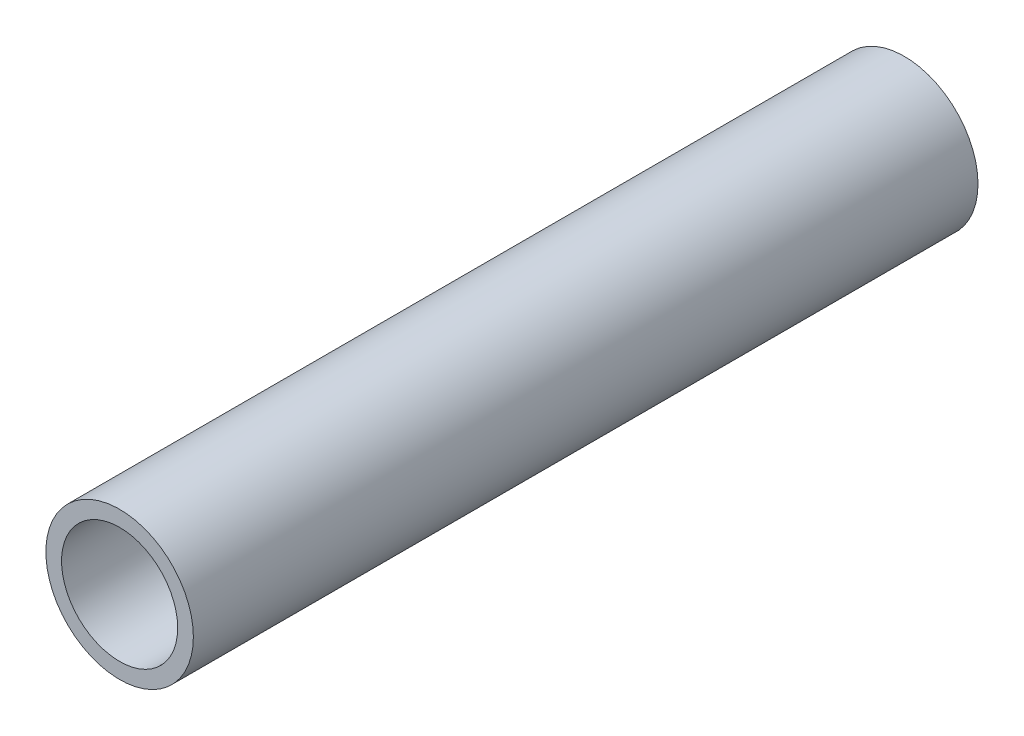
ISO-10303-21;
HEADER;
FILE_DESCRIPTION(('STEP AP214'),'2;1');
FILE_NAME('part.step','',(''),(''),'','','');
FILE_SCHEMA(('AUTOMOTIVE_DESIGN { 1 0 10303 214 1 1 1 1 }'));
ENDSEC;
DATA;
#1=APPLICATION_CONTEXT('core data for automotive mechanical design processes');
#2=APPLICATION_PROTOCOL_DEFINITION('international standard','automotive_design',2000,#1);
#3=PRODUCT_CONTEXT('',#1,'mechanical');
#4=PRODUCT('Part','Part','',(#3));
#5=PRODUCT_RELATED_PRODUCT_CATEGORY('part','',(#4));
#6=PRODUCT_DEFINITION_FORMATION('','',#4);
#7=PRODUCT_DEFINITION_CONTEXT('part definition',#1,'design');
#8=PRODUCT_DEFINITION('design','',#6,#7);
#9=PRODUCT_DEFINITION_SHAPE('','',#8);
#10=(LENGTH_UNIT() NAMED_UNIT(*) SI_UNIT(.MILLI.,.METRE.));
#11=(NAMED_UNIT(*) PLANE_ANGLE_UNIT() SI_UNIT($,.RADIAN.));
#12=(NAMED_UNIT(*) SI_UNIT($,.STERADIAN.) SOLID_ANGLE_UNIT());
#13=UNCERTAINTY_MEASURE_WITH_UNIT(LENGTH_MEASURE(1.E-05),#10,'distance_accuracy_value','');
#14=(GEOMETRIC_REPRESENTATION_CONTEXT(3) GLOBAL_UNCERTAINTY_ASSIGNED_CONTEXT((#13)) GLOBAL_UNIT_ASSIGNED_CONTEXT((#10,
#11,#12)) REPRESENTATION_CONTEXT('',''));
#15=CARTESIAN_POINT('',(0.,0.,0.));
#16=DIRECTION('',(0.,0.,1.));
#17=DIRECTION('',(1.,0.,0.));
#18=AXIS2_PLACEMENT_3D('',#15,#16,#17);
#19=CARTESIAN_POINT('',(0.,0.,12.7));
#20=DIRECTION('',(0.,0.,-1.));
#21=DIRECTION('',(-1.,0.,0.));
#22=AXIS2_PLACEMENT_3D('',#19,#20,#21);
#23=CYLINDRICAL_SURFACE('',#22,1.1938);
#24=CARTESIAN_POINT('',(0.,0.,12.7));
#25=DIRECTION('',(0.,0.,1.));
#26=DIRECTION('',(1.,0.,0.));
#27=AXIS2_PLACEMENT_3D('',#24,#25,#26);
#28=CIRCLE('',#27,1.1938);
#29=CARTESIAN_POINT('',(1.1938,0.,12.7));
#30=VERTEX_POINT('',#29);
#31=EDGE_CURVE('E10',#30,#30,#28,.T.);
#32=ORIENTED_EDGE('',*,*,#31,.F.);
#33=EDGE_LOOP('',(#32));
#34=FACE_BOUND('',#33,.T.);
#35=CARTESIAN_POINT('',(0.,0.,0.));
#36=DIRECTION('',(0.,0.,1.));
#37=DIRECTION('',(1.,0.,0.));
#38=AXIS2_PLACEMENT_3D('',#35,#36,#37);
#39=CIRCLE('',#38,1.1938);
#40=CARTESIAN_POINT('',(1.1938,0.,0.));
#41=VERTEX_POINT('',#40);
#42=EDGE_CURVE('E36',#41,#41,#39,.T.);
#43=ORIENTED_EDGE('',*,*,#42,.T.);
#44=EDGE_LOOP('',(#43));
#45=FACE_BOUND('',#44,.T.);
#46=ADVANCED_FACE('F30',(#34,#45),#23,.T.);
#47=CARTESIAN_POINT('',(0.,0.,12.7));
#48=DIRECTION('',(0.,0.,1.));
#49=DIRECTION('',(1.,0.,0.));
#50=AXIS2_PLACEMENT_3D('',#47,#48,#49);
#51=PLANE('',#50);
#52=CARTESIAN_POINT('',(0.,0.,12.7));
#53=DIRECTION('',(0.,0.,1.));
#54=DIRECTION('',(1.,0.,0.));
#55=AXIS2_PLACEMENT_3D('',#52,#53,#54);
#56=CIRCLE('',#55,0.9398);
#57=CARTESIAN_POINT('',(0.9398,0.,12.7));
#58=VERTEX_POINT('',#57);
#59=EDGE_CURVE('E40',#58,#58,#56,.T.);
#60=ORIENTED_EDGE('',*,*,#59,.F.);
#61=EDGE_LOOP('',(#60));
#62=FACE_BOUND('',#61,.T.);
#63=ORIENTED_EDGE('',*,*,#31,.T.);
#64=EDGE_LOOP('',(#63));
#65=FACE_BOUND('',#64,.T.);
#66=ADVANCED_FACE('F60',(#62,#65),#51,.T.);
#67=CARTESIAN_POINT('',(0.,0.,0.));
#68=DIRECTION('',(0.,0.,1.));
#69=DIRECTION('',(1.,0.,0.));
#70=AXIS2_PLACEMENT_3D('',#67,#68,#69);
#71=PLANE('',#70);
#72=CARTESIAN_POINT('',(0.,0.,0.));
#73=DIRECTION('',(0.,0.,1.));
#74=DIRECTION('',(1.,0.,0.));
#75=AXIS2_PLACEMENT_3D('',#72,#73,#74);
#76=CIRCLE('',#75,0.9398);
#77=CARTESIAN_POINT('',(0.9398,0.,0.));
#78=VERTEX_POINT('',#77);
#79=EDGE_CURVE('E44',#78,#78,#76,.T.);
#80=ORIENTED_EDGE('',*,*,#79,.T.);
#81=EDGE_LOOP('',(#80));
#82=FACE_BOUND('',#81,.T.);
#83=ORIENTED_EDGE('',*,*,#42,.F.);
#84=EDGE_LOOP('',(#83));
#85=FACE_BOUND('',#84,.T.);
#86=ADVANCED_FACE('F50',(#82,#85),#71,.F.);
#87=CARTESIAN_POINT('',(0.,0.,12.7));
#88=DIRECTION('',(0.,0.,-1.));
#89=DIRECTION('',(-1.,0.,0.));
#90=AXIS2_PLACEMENT_3D('',#87,#88,#89);
#91=CYLINDRICAL_SURFACE('',#90,0.9398);
#92=ORIENTED_EDGE('',*,*,#59,.T.);
#93=EDGE_LOOP('',(#92));
#94=FACE_BOUND('',#93,.T.);
#95=ORIENTED_EDGE('',*,*,#79,.F.);
#96=EDGE_LOOP('',(#95));
#97=FACE_BOUND('',#96,.T.);
#98=ADVANCED_FACE('F53',(#94,#97),#91,.F.);
#99=CLOSED_SHELL('',(#46,#66,#86,#98));
#100=MANIFOLD_SOLID_BREP('B2',#99);
#101=ADVANCED_BREP_SHAPE_REPRESENTATION('',(#18,#100),#14);
#102=SHAPE_DEFINITION_REPRESENTATION(#9,#101);
ENDSEC;
END-ISO-10303-21;
